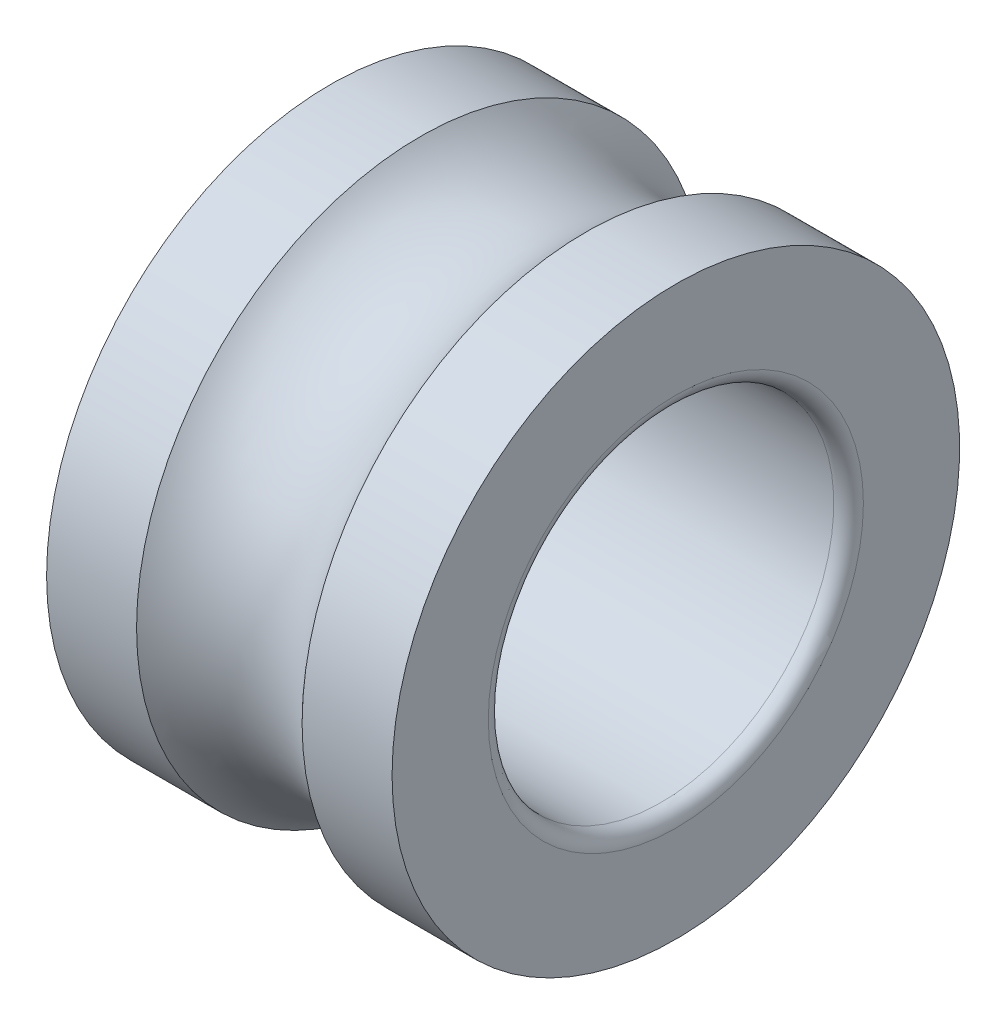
from build123d import *


with BuildPart() as part:
    # Esquisse1 → Base-R_volution (revolve)
    with BuildSketch(Plane(origin=(0, 0, 0), x_dir=(1, 0, 0), z_dir=(0, 1, 0)), mode=Mode.PRIVATE) as base_r_volution_sk:
        with BuildLine():
            Line((0, 5.75), (0, 3.8))
            ThreePointArc((0, 3.8), (0.087867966, 3.587867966), (0.3, 3.5))
            Line((0.3, 3.5), (6.7, 3.5))
            ThreePointArc((6.7, 3.5), (6.912132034, 3.587867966), (7, 3.8))
            Line((7, 3.8), (7, 5.75))
            Line((7, 5.75), (5.177050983, 5.75))
            ThreePointArc((5.177050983, 5.75), (3.5, 5), (1.822949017, 5.75))
            Line((1.822949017, 5.75), (0, 5.75))
        make_face()
    revolve(base_r_volution_sk.sketch.rotate(Axis((0, 0, 0), (1, 0, 0)), 180), axis=Axis((0, 0, 0), (1, 0, 0)))


solid = part.part
